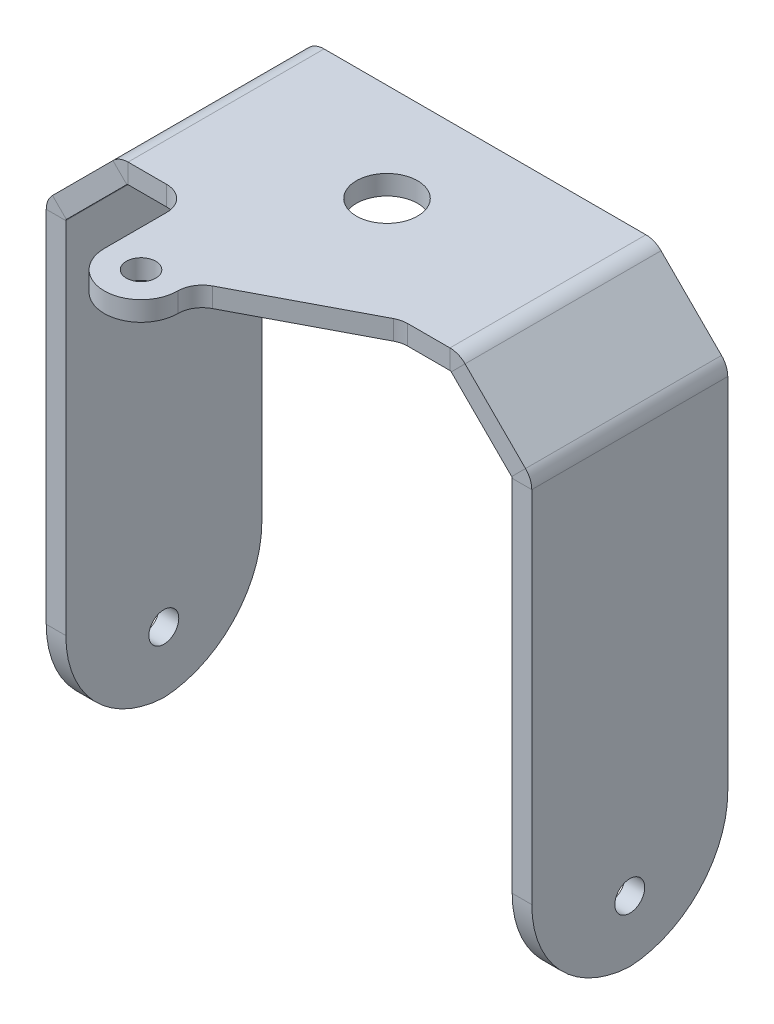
ISO-10303-21;
HEADER;
FILE_DESCRIPTION(('STEP AP214'),'2;1');
FILE_NAME('part.step','',(''),(''),'','','');
FILE_SCHEMA(('AUTOMOTIVE_DESIGN { 1 0 10303 214 1 1 1 1 }'));
ENDSEC;
DATA;
#1=APPLICATION_CONTEXT('core data for automotive mechanical design processes');
#2=APPLICATION_PROTOCOL_DEFINITION('international standard','automotive_design',2000,#1);
#3=PRODUCT_CONTEXT('',#1,'mechanical');
#4=PRODUCT('Part','Part','',(#3));
#5=PRODUCT_RELATED_PRODUCT_CATEGORY('part','',(#4));
#6=PRODUCT_DEFINITION_FORMATION('','',#4);
#7=PRODUCT_DEFINITION_CONTEXT('part definition',#1,'design');
#8=PRODUCT_DEFINITION('design','',#6,#7);
#9=PRODUCT_DEFINITION_SHAPE('','',#8);
#10=(LENGTH_UNIT() NAMED_UNIT(*) SI_UNIT(.MILLI.,.METRE.));
#11=(NAMED_UNIT(*) PLANE_ANGLE_UNIT() SI_UNIT($,.RADIAN.));
#12=(NAMED_UNIT(*) SI_UNIT($,.STERADIAN.) SOLID_ANGLE_UNIT());
#13=UNCERTAINTY_MEASURE_WITH_UNIT(LENGTH_MEASURE(1.E-05),#10,'distance_accuracy_value','');
#14=(GEOMETRIC_REPRESENTATION_CONTEXT(3) GLOBAL_UNCERTAINTY_ASSIGNED_CONTEXT((#13)) GLOBAL_UNIT_ASSIGNED_CONTEXT((#10,
#11,#12)) REPRESENTATION_CONTEXT('',''));
#15=CARTESIAN_POINT('',(0.,0.,0.));
#16=DIRECTION('',(0.,0.,1.));
#17=DIRECTION('',(1.,0.,0.));
#18=AXIS2_PLACEMENT_3D('',#15,#16,#17);
#19=CARTESIAN_POINT('',(99.1022907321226,-25.1022907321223,40.));
#20=DIRECTION('',(1.,0.,0.));
#21=DIRECTION('',(0.,1.,0.));
#22=AXIS2_PLACEMENT_3D('',#19,#20,#21);
#23=PLANE('',#22);
#24=CARTESIAN_POINT('',(99.1022907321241,-189.054644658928,0.));
#25=DIRECTION('',(1.,0.,0.));
#26=DIRECTION('',(0.,1.,0.));
#27=AXIS2_PLACEMENT_3D('',#24,#25,#26);
#28=CIRCLE('',#27,6.1);
#29=CARTESIAN_POINT('',(99.1022907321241,-182.954644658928,0.));
#30=VERTEX_POINT('',#29);
#31=EDGE_CURVE('E1169',#30,#30,#28,.T.);
#32=ORIENTED_EDGE('',*,*,#31,.F.);
#33=EDGE_LOOP('',(#32));
#34=FACE_BOUND('',#33,.T.);
#35=CARTESIAN_POINT('',(99.102290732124,-172.102290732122,-2.));
#36=DIRECTION('',(1.,0.,0.));
#37=DIRECTION('',(0.,1.,0.));
#38=AXIS2_PLACEMENT_3D('',#35,#36,#37);
#39=CIRCLE('',#38,42.);
#40=CARTESIAN_POINT('',(99.1022907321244,-214.054644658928,3.00107161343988E-13));
#41=VERTEX_POINT('',#40);
#42=CARTESIAN_POINT('',(99.102290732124,-172.102290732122,40.));
#43=VERTEX_POINT('',#42);
#44=EDGE_CURVE('E246',#41,#43,#39,.F.);
#45=ORIENTED_EDGE('',*,*,#44,.F.);
#46=CARTESIAN_POINT('',(99.102290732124,-172.102290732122,2.));
#47=DIRECTION('',(1.,0.,0.));
#48=DIRECTION('',(0.,1.,0.));
#49=AXIS2_PLACEMENT_3D('',#46,#47,#48);
#50=CIRCLE('',#49,42.);
#51=CARTESIAN_POINT('',(99.102290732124,-172.102290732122,-40.));
#52=VERTEX_POINT('',#51);
#53=EDGE_CURVE('E49',#41,#52,#50,.T.);
#54=ORIENTED_EDGE('',*,*,#53,.T.);
#55=DIRECTION('',(0.,-1.,0.));
#56=VECTOR('',#55,1.);
#57=CARTESIAN_POINT('',(99.1022907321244,-214.102290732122,-40.));
#58=LINE('',#57,#56);
#59=CARTESIAN_POINT('',(99.1022907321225,-25.4074004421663,-40.));
#60=VERTEX_POINT('',#59);
#61=EDGE_CURVE('E270',#60,#52,#58,.T.);
#62=ORIENTED_EDGE('',*,*,#61,.F.);
#63=DIRECTION('',(0.,0.,1.));
#64=VECTOR('',#63,1.);
#65=CARTESIAN_POINT('',(99.1022907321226,-25.4074004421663,40.));
#66=LINE('',#65,#64);
#67=CARTESIAN_POINT('',(99.1022907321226,-25.4074004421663,40.));
#68=VERTEX_POINT('',#67);
#69=EDGE_CURVE('E262',#60,#68,#66,.T.);
#70=ORIENTED_EDGE('',*,*,#69,.T.);
#71=DIRECTION('',(0.,1.,0.));
#72=VECTOR('',#71,1.);
#73=CARTESIAN_POINT('',(99.1022907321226,-25.1022907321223,40.));
#74=LINE('',#73,#72);
#75=EDGE_CURVE('E273',#43,#68,#74,.T.);
#76=ORIENTED_EDGE('',*,*,#75,.F.);
#77=EDGE_LOOP('',(#45,#54,#62,#70,#76));
#78=FACE_BOUND('',#77,.T.);
#79=ADVANCED_FACE('F33',(#34,#78),#23,.T.);
#80=CARTESIAN_POINT('',(91.1022907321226,-25.1022907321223,40.));
#81=DIRECTION('',(1.,0.,0.));
#82=DIRECTION('',(0.,1.,0.));
#83=AXIS2_PLACEMENT_3D('',#80,#81,#82);
#84=PLANE('',#83);
#85=CARTESIAN_POINT('',(91.1022907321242,-189.054644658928,0.));
#86=DIRECTION('',(1.,0.,0.));
#87=DIRECTION('',(0.,1.,0.));
#88=AXIS2_PLACEMENT_3D('',#85,#86,#87);
#89=CIRCLE('',#88,6.1);
#90=CARTESIAN_POINT('',(91.1022907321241,-182.954644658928,0.));
#91=VERTEX_POINT('',#90);
#92=EDGE_CURVE('E240',#91,#91,#89,.T.);
#93=ORIENTED_EDGE('',*,*,#92,.T.);
#94=EDGE_LOOP('',(#93));
#95=FACE_BOUND('',#94,.T.);
#96=CARTESIAN_POINT('',(91.102290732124,-172.102290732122,2.));
#97=DIRECTION('',(1.,0.,0.));
#98=DIRECTION('',(0.,1.,0.));
#99=AXIS2_PLACEMENT_3D('',#96,#97,#98);
#100=CIRCLE('',#99,42.);
#101=CARTESIAN_POINT('',(91.1022907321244,-214.054644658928,2.97071395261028E-13));
#102=VERTEX_POINT('',#101);
#103=CARTESIAN_POINT('',(91.1022907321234,-172.102290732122,-40.));
#104=VERTEX_POINT('',#103);
#105=EDGE_CURVE('E225',#102,#104,#100,.T.);
#106=ORIENTED_EDGE('',*,*,#105,.F.);
#107=CARTESIAN_POINT('',(91.102290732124,-172.102290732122,-2.));
#108=DIRECTION('',(1.,0.,0.));
#109=DIRECTION('',(0.,1.,0.));
#110=AXIS2_PLACEMENT_3D('',#107,#108,#109);
#111=CIRCLE('',#110,42.);
#112=CARTESIAN_POINT('',(91.1022907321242,-172.102290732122,40.));
#113=VERTEX_POINT('',#112);
#114=EDGE_CURVE('E235',#102,#113,#111,.F.);
#115=ORIENTED_EDGE('',*,*,#114,.T.);
#116=DIRECTION('',(0.,1.,0.));
#117=VECTOR('',#116,1.);
#118=CARTESIAN_POINT('',(91.1022907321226,-25.1022907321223,40.));
#119=LINE('',#118,#117);
#120=CARTESIAN_POINT('',(91.1022907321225,-25.4074004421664,40.));
#121=VERTEX_POINT('',#120);
#122=EDGE_CURVE('E268',#113,#121,#119,.T.);
#123=ORIENTED_EDGE('',*,*,#122,.T.);
#124=DIRECTION('',(0.,0.,1.));
#125=VECTOR('',#124,1.);
#126=CARTESIAN_POINT('',(91.1022907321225,-25.4074004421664,-40.));
#127=LINE('',#126,#125);
#128=CARTESIAN_POINT('',(91.1022907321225,-25.4074004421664,-40.));
#129=VERTEX_POINT('',#128);
#130=EDGE_CURVE('E256',#129,#121,#127,.T.);
#131=ORIENTED_EDGE('',*,*,#130,.F.);
#132=DIRECTION('',(0.,-1.,0.));
#133=VECTOR('',#132,1.);
#134=CARTESIAN_POINT('',(91.1022907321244,-214.102290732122,-40.));
#135=LINE('',#134,#133);
#136=EDGE_CURVE('E239',#129,#104,#135,.T.);
#137=ORIENTED_EDGE('',*,*,#136,.T.);
#138=EDGE_LOOP('',(#106,#115,#123,#131,#137));
#139=FACE_BOUND('',#138,.T.);
#140=ADVANCED_FACE('F234',(#95,#139),#84,.F.);
#141=CARTESIAN_POINT('',(91.102290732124,-172.102290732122,-2.));
#142=DIRECTION('',(1.,0.,0.));
#143=DIRECTION('',(0.,1.,0.));
#144=AXIS2_PLACEMENT_3D('',#141,#142,#143);
#145=CYLINDRICAL_SURFACE('',#144,42.);
#146=ORIENTED_EDGE('',*,*,#114,.F.);
#147=DIRECTION('',(-1.,0.,0.));
#148=VECTOR('',#147,1.);
#149=CARTESIAN_POINT('',(91.1022907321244,-214.054644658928,2.97071395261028E-13));
#150=LINE('',#149,#148);
#151=EDGE_CURVE('E222',#102,#41,#150,.F.);
#152=ORIENTED_EDGE('',*,*,#151,.T.);
#153=ORIENTED_EDGE('',*,*,#44,.T.);
#154=DIRECTION('',(-1.,0.,0.));
#155=VECTOR('',#154,1.);
#156=CARTESIAN_POINT('',(91.1022907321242,-172.102290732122,40.));
#157=LINE('',#156,#155);
#158=EDGE_CURVE('E244',#113,#43,#157,.F.);
#159=ORIENTED_EDGE('',*,*,#158,.F.);
#160=EDGE_LOOP('',(#146,#152,#153,#159));
#161=FACE_BOUND('',#160,.T.);
#162=ADVANCED_FACE('F242',(#161),#145,.T.);
#163=CARTESIAN_POINT('',(-99.1022907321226,-25.1022907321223,-40.));
#164=DIRECTION('',(-1.,0.,0.));
#165=DIRECTION('',(0.,-1.,0.));
#166=AXIS2_PLACEMENT_3D('',#163,#164,#165);
#167=PLANE('',#166);
#168=CARTESIAN_POINT('',(-99.1022907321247,-189.05464465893,1.29683751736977E-13));
#169=DIRECTION('',(1.,0.,0.));
#170=DIRECTION('',(0.,1.,0.));
#171=AXIS2_PLACEMENT_3D('',#168,#169,#170);
#172=CIRCLE('',#171,6.1);
#173=CARTESIAN_POINT('',(-99.1022907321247,-182.95464465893,1.29683751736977E-13));
#174=VERTEX_POINT('',#173);
#175=EDGE_CURVE('E1174',#174,#174,#172,.T.);
#176=ORIENTED_EDGE('',*,*,#175,.T.);
#177=EDGE_LOOP('',(#176));
#178=FACE_BOUND('',#177,.T.);
#179=DIRECTION('',(0.,1.,0.));
#180=VECTOR('',#179,1.);
#181=CARTESIAN_POINT('',(-99.1022907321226,-25.1022907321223,-40.));
#182=LINE('',#181,#180);
#183=CARTESIAN_POINT('',(-99.102290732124,-172.102290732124,-40.0000000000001));
#184=VERTEX_POINT('',#183);
#185=CARTESIAN_POINT('',(-99.1022907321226,-25.4074004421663,-40.));
#186=VERTEX_POINT('',#185);
#187=EDGE_CURVE('E318',#184,#186,#182,.T.);
#188=ORIENTED_EDGE('',*,*,#187,.F.);
#189=CARTESIAN_POINT('',(-99.102290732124,-172.102290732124,1.99999999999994));
#190=DIRECTION('',(-1.,0.,0.));
#191=DIRECTION('',(0.,-1.,0.));
#192=AXIS2_PLACEMENT_3D('',#189,#190,#191);
#193=CIRCLE('',#192,42.);
#194=CARTESIAN_POINT('',(-99.1022907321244,-214.054644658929,1.86656246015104E-11));
#195=VERTEX_POINT('',#194);
#196=EDGE_CURVE('E1181',#184,#195,#193,.T.);
#197=ORIENTED_EDGE('',*,*,#196,.T.);
#198=CARTESIAN_POINT('',(-99.102290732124,-172.102290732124,-1.99999999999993));
#199=DIRECTION('',(-1.,0.,0.));
#200=DIRECTION('',(0.,-1.,0.));
#201=AXIS2_PLACEMENT_3D('',#198,#199,#200);
#202=CIRCLE('',#201,42.);
#203=CARTESIAN_POINT('',(-99.102290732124,-172.102290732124,40.0000000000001));
#204=VERTEX_POINT('',#203);
#205=EDGE_CURVE('E250',#204,#195,#202,.F.);
#206=ORIENTED_EDGE('',*,*,#205,.F.);
#207=DIRECTION('',(0.,-1.,0.));
#208=VECTOR('',#207,1.);
#209=CARTESIAN_POINT('',(-99.1022907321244,-214.102290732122,40.));
#210=LINE('',#209,#208);
#211=CARTESIAN_POINT('',(-99.1022907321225,-25.4074004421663,40.));
#212=VERTEX_POINT('',#211);
#213=EDGE_CURVE('E315',#212,#204,#210,.T.);
#214=ORIENTED_EDGE('',*,*,#213,.F.);
#215=DIRECTION('',(0.,0.,-1.));
#216=VECTOR('',#215,1.);
#217=CARTESIAN_POINT('',(-99.1022907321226,-25.4074004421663,-40.));
#218=LINE('',#217,#216);
#219=EDGE_CURVE('E305',#212,#186,#218,.T.);
#220=ORIENTED_EDGE('',*,*,#219,.T.);
#221=EDGE_LOOP('',(#188,#197,#206,#214,#220));
#222=FACE_BOUND('',#221,.T.);
#223=ADVANCED_FACE('F665',(#178,#222),#167,.T.);
#224=CARTESIAN_POINT('',(-91.1022907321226,-25.1022907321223,-40.));
#225=DIRECTION('',(-1.,0.,0.));
#226=DIRECTION('',(0.,-1.,0.));
#227=AXIS2_PLACEMENT_3D('',#224,#225,#226);
#228=PLANE('',#227);
#229=CARTESIAN_POINT('',(-91.1022907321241,-189.05464465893,1.26908194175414E-13));
#230=DIRECTION('',(-1.,0.,0.));
#231=DIRECTION('',(0.,-1.,0.));
#232=AXIS2_PLACEMENT_3D('',#229,#230,#231);
#233=CIRCLE('',#232,6.1);
#234=CARTESIAN_POINT('',(-91.1022907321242,-195.15464465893,1.26908194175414E-13));
#235=VERTEX_POINT('',#234);
#236=EDGE_CURVE('E37',#235,#235,#233,.T.);
#237=ORIENTED_EDGE('',*,*,#236,.T.);
#238=EDGE_LOOP('',(#237));
#239=FACE_BOUND('',#238,.T.);
#240=CARTESIAN_POINT('',(-91.102290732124,-172.102290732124,1.99999999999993));
#241=DIRECTION('',(-1.,0.,0.));
#242=DIRECTION('',(0.,-1.,0.));
#243=AXIS2_PLACEMENT_3D('',#240,#241,#242);
#244=CIRCLE('',#243,42.);
#245=CARTESIAN_POINT('',(-91.1022907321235,-172.102290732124,-40.0000000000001));
#246=VERTEX_POINT('',#245);
#247=CARTESIAN_POINT('',(-91.1022907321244,-214.05464465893,0.));
#248=VERTEX_POINT('',#247);
#249=EDGE_CURVE('E57',#246,#248,#244,.T.);
#250=ORIENTED_EDGE('',*,*,#249,.F.);
#251=DIRECTION('',(0.,1.,0.));
#252=VECTOR('',#251,1.);
#253=CARTESIAN_POINT('',(-91.1022907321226,-25.1022907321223,-40.));
#254=LINE('',#253,#252);
#255=CARTESIAN_POINT('',(-91.1022907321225,-25.4074004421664,-40.));
#256=VERTEX_POINT('',#255);
#257=EDGE_CURVE('E313',#246,#256,#254,.T.);
#258=ORIENTED_EDGE('',*,*,#257,.T.);
#259=DIRECTION('',(0.,0.,-1.));
#260=VECTOR('',#259,1.);
#261=CARTESIAN_POINT('',(-91.1022907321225,-25.4074004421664,40.));
#262=LINE('',#261,#260);
#263=CARTESIAN_POINT('',(-91.1022907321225,-25.4074004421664,40.));
#264=VERTEX_POINT('',#263);
#265=EDGE_CURVE('E299',#264,#256,#262,.T.);
#266=ORIENTED_EDGE('',*,*,#265,.F.);
#267=DIRECTION('',(0.,-1.,0.));
#268=VECTOR('',#267,1.);
#269=CARTESIAN_POINT('',(-91.1022907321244,-214.102290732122,40.));
#270=LINE('',#269,#268);
#271=CARTESIAN_POINT('',(-91.1022907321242,-172.102290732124,40.0000000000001));
#272=VERTEX_POINT('',#271);
#273=EDGE_CURVE('E310',#264,#272,#270,.T.);
#274=ORIENTED_EDGE('',*,*,#273,.T.);
#275=CARTESIAN_POINT('',(-91.102290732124,-172.102290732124,-1.99999999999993));
#276=DIRECTION('',(-1.,0.,0.));
#277=DIRECTION('',(0.,-1.,0.));
#278=AXIS2_PLACEMENT_3D('',#275,#276,#277);
#279=CIRCLE('',#278,42.);
#280=EDGE_CURVE('E1187',#272,#248,#279,.F.);
#281=ORIENTED_EDGE('',*,*,#280,.T.);
#282=EDGE_LOOP('',(#250,#258,#266,#274,#281));
#283=FACE_BOUND('',#282,.T.);
#284=ADVANCED_FACE('F669',(#239,#283),#228,.F.);
#285=CARTESIAN_POINT('',(-99.1022907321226,-25.1022907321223,-40.));
#286=DIRECTION('',(0.,0.,-1.));
#287=DIRECTION('',(-1.,0.,0.));
#288=AXIS2_PLACEMENT_3D('',#285,#286,#287);
#289=PLANE('',#288);
#290=ORIENTED_EDGE('',*,*,#257,.F.);
#291=DIRECTION('',(1.,0.,0.));
#292=VECTOR('',#291,1.);
#293=CARTESIAN_POINT('',(-91.1022907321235,-172.102290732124,-40.0000000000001));
#294=LINE('',#293,#292);
#295=EDGE_CURVE('E1184',#246,#184,#294,.F.);
#296=ORIENTED_EDGE('',*,*,#295,.T.);
#297=ORIENTED_EDGE('',*,*,#187,.T.);
#298=DIRECTION('',(-1.,0.,0.));
#299=VECTOR('',#298,1.);
#300=CARTESIAN_POINT('',(-91.1022907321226,-25.4074004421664,-40.));
#301=LINE('',#300,#299);
#302=EDGE_CURVE('E302',#256,#186,#301,.T.);
#303=ORIENTED_EDGE('',*,*,#302,.F.);
#304=EDGE_LOOP('',(#290,#296,#297,#303));
#305=FACE_BOUND('',#304,.T.);
#306=ADVANCED_FACE('F662',(#305),#289,.T.);
#307=CARTESIAN_POINT('',(-91.102290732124,-172.102290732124,-1.99999999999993));
#308=DIRECTION('',(-1.,0.,0.));
#309=DIRECTION('',(0.,-1.,0.));
#310=AXIS2_PLACEMENT_3D('',#307,#308,#309);
#311=CYLINDRICAL_SURFACE('',#310,42.);
#312=ORIENTED_EDGE('',*,*,#205,.T.);
#313=DIRECTION('',(1.,0.,0.));
#314=VECTOR('',#313,1.);
#315=CARTESIAN_POINT('',(-91.1022907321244,-214.054644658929,1.86656246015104E-11));
#316=LINE('',#315,#314);
#317=EDGE_CURVE('E1185',#248,#195,#316,.F.);
#318=ORIENTED_EDGE('',*,*,#317,.F.);
#319=ORIENTED_EDGE('',*,*,#280,.F.);
#320=DIRECTION('',(1.,0.,0.));
#321=VECTOR('',#320,1.);
#322=CARTESIAN_POINT('',(-91.1022907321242,-172.102290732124,40.0000000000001));
#323=LINE('',#322,#321);
#324=EDGE_CURVE('E247',#272,#204,#323,.F.);
#325=ORIENTED_EDGE('',*,*,#324,.T.);
#326=EDGE_LOOP('',(#312,#318,#319,#325));
#327=FACE_BOUND('',#326,.T.);
#328=ADVANCED_FACE('F647',(#327),#311,.T.);
#329=CARTESIAN_POINT('',(99.1022907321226,-25.1022907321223,40.));
#330=DIRECTION('',(0.,0.,1.));
#331=DIRECTION('',(1.,0.,0.));
#332=AXIS2_PLACEMENT_3D('',#329,#330,#331);
#333=PLANE('',#332);
#334=ORIENTED_EDGE('',*,*,#122,.F.);
#335=ORIENTED_EDGE('',*,*,#158,.T.);
#336=ORIENTED_EDGE('',*,*,#75,.T.);
#337=DIRECTION('',(1.,0.,0.));
#338=VECTOR('',#337,1.);
#339=CARTESIAN_POINT('',(91.1022907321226,-25.4074004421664,40.));
#340=LINE('',#339,#338);
#341=EDGE_CURVE('E259',#121,#68,#340,.T.);
#342=ORIENTED_EDGE('',*,*,#341,.F.);
#343=EDGE_LOOP('',(#334,#335,#336,#342));
#344=FACE_BOUND('',#343,.T.);
#345=ADVANCED_FACE('F619',(#344),#333,.T.);
#346=CARTESIAN_POINT('',(96.7591449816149,-19.4454364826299,40.));
#347=DIRECTION('',(0.,0.,1.));
#348=DIRECTION('',(0.,-1.,0.));
#349=AXIS2_PLACEMENT_3D('',#346,#347,#348);
#350=PLANE('',#349);
#351=DIRECTION('',(-0.707106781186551,0.707106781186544,0.));
#352=VECTOR('',#351,1.);
#353=CARTESIAN_POINT('',(91.1022907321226,-25.1022907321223,40.));
#354=LINE('',#353,#352);
#355=CARTESIAN_POINT('',(90.8865455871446,-24.8865455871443,40.));
#356=VERTEX_POINT('',#355);
#357=CARTESIAN_POINT('',(66.215745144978,-0.215745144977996,40.));
#358=VERTEX_POINT('',#357);
#359=EDGE_CURVE('E357',#356,#358,#354,.T.);
#360=ORIENTED_EDGE('',*,*,#359,.F.);
#361=DIRECTION('',(0.707106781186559,0.707106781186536,0.));
#362=VECTOR('',#361,1.);
#363=CARTESIAN_POINT('',(90.8865455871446,-24.8865455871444,40.));
#364=LINE('',#363,#362);
#365=CARTESIAN_POINT('',(96.543399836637,-19.2296913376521,40.));
#366=VERTEX_POINT('',#365);
#367=EDGE_CURVE('E290',#356,#366,#364,.T.);
#368=ORIENTED_EDGE('',*,*,#367,.T.);
#369=DIRECTION('',(-0.707106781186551,0.707106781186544,0.));
#370=VECTOR('',#369,1.);
#371=CARTESIAN_POINT('',(96.7591449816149,-19.4454364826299,40.));
#372=LINE('',#371,#370);
#373=CARTESIAN_POINT('',(71.8725993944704,5.44110910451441,40.));
#374=VERTEX_POINT('',#373);
#375=EDGE_CURVE('E362',#366,#374,#372,.T.);
#376=ORIENTED_EDGE('',*,*,#375,.T.);
#377=DIRECTION('',(0.707106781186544,0.707106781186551,0.));
#378=VECTOR('',#377,1.);
#379=CARTESIAN_POINT('',(66.215745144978,-0.215745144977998,40.));
#380=LINE('',#379,#378);
#381=EDGE_CURVE('E347',#358,#374,#380,.T.);
#382=ORIENTED_EDGE('',*,*,#381,.F.);
#383=EDGE_LOOP('',(#360,#368,#376,#382));
#384=FACE_BOUND('',#383,.T.);
#385=ADVANCED_FACE('F593',(#384),#350,.T.);
#386=CARTESIAN_POINT('',(71.6568542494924,5.65685424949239,40.));
#387=DIRECTION('',(-0.707106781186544,-0.707106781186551,0.));
#388=DIRECTION('',(0.707106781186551,-0.707106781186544,0.));
#389=AXIS2_PLACEMENT_3D('',#386,#387,#388);
#390=PLANE('',#389);
#391=DIRECTION('',(0.,0.,1.));
#392=VECTOR('',#391,1.);
#393=CARTESIAN_POINT('',(96.543399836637,-19.2296913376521,40.));
#394=LINE('',#393,#392);
#395=CARTESIAN_POINT('',(96.5433998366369,-19.229691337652,-40.));
#396=VERTEX_POINT('',#395);
#397=EDGE_CURVE('E285',#366,#396,#394,.F.);
#398=ORIENTED_EDGE('',*,*,#397,.T.);
#399=DIRECTION('',(0.707106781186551,-0.707106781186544,0.));
#400=VECTOR('',#399,1.);
#401=CARTESIAN_POINT('',(71.6568542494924,5.6568542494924,-40.));
#402=LINE('',#401,#400);
#403=CARTESIAN_POINT('',(71.8725993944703,5.44110910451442,-40.));
#404=VERTEX_POINT('',#403);
#405=EDGE_CURVE('E359',#404,#396,#402,.T.);
#406=ORIENTED_EDGE('',*,*,#405,.F.);
#407=DIRECTION('',(0.,0.,-1.));
#408=VECTOR('',#407,1.);
#409=CARTESIAN_POINT('',(71.8725993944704,5.44110910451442,40.));
#410=LINE('',#409,#408);
#411=EDGE_CURVE('E350',#374,#404,#410,.T.);
#412=ORIENTED_EDGE('',*,*,#411,.F.);
#413=ORIENTED_EDGE('',*,*,#375,.F.);
#414=EDGE_LOOP('',(#398,#406,#412,#413));
#415=FACE_BOUND('',#414,.T.);
#416=ADVANCED_FACE('F597',(#415),#390,.F.);
#417=CARTESIAN_POINT('',(66.,0.,40.));
#418=DIRECTION('',(-0.707106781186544,-0.707106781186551,0.));
#419=DIRECTION('',(0.707106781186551,-0.707106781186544,0.));
#420=AXIS2_PLACEMENT_3D('',#417,#418,#419);
#421=PLANE('',#420);
#422=DIRECTION('',(0.707106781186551,-0.707106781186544,0.));
#423=VECTOR('',#422,1.);
#424=CARTESIAN_POINT('',(66.,0.,-40.));
#425=LINE('',#424,#423);
#426=CARTESIAN_POINT('',(66.215745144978,-0.215745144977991,-40.));
#427=VERTEX_POINT('',#426);
#428=CARTESIAN_POINT('',(90.8865455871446,-24.8865455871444,-40.));
#429=VERTEX_POINT('',#428);
#430=EDGE_CURVE('E354',#427,#429,#425,.T.);
#431=ORIENTED_EDGE('',*,*,#430,.T.);
#432=DIRECTION('',(0.,0.,1.));
#433=VECTOR('',#432,1.);
#434=CARTESIAN_POINT('',(90.8865455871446,-24.8865455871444,40.));
#435=LINE('',#434,#433);
#436=EDGE_CURVE('E280',#356,#429,#435,.F.);
#437=ORIENTED_EDGE('',*,*,#436,.F.);
#438=ORIENTED_EDGE('',*,*,#359,.T.);
#439=DIRECTION('',(0.,0.,1.));
#440=VECTOR('',#439,1.);
#441=CARTESIAN_POINT('',(66.215745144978,-0.215745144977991,-40.));
#442=LINE('',#441,#440);
#443=EDGE_CURVE('E344',#427,#358,#442,.T.);
#444=ORIENTED_EDGE('',*,*,#443,.F.);
#445=EDGE_LOOP('',(#431,#437,#438,#444));
#446=FACE_BOUND('',#445,.T.);
#447=ADVANCED_FACE('F697',(#446),#421,.T.);
#448=CARTESIAN_POINT('',(-71.6568542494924,5.6568542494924,-40.));
#449=DIRECTION('',(0.,0.,-1.));
#450=DIRECTION('',(-1.,0.,0.));
#451=AXIS2_PLACEMENT_3D('',#448,#449,#450);
#452=PLANE('',#451);
#453=DIRECTION('',(0.707106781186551,0.707106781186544,0.));
#454=VECTOR('',#453,1.);
#455=CARTESIAN_POINT('',(-66.,0.,-40.));
#456=LINE('',#455,#454);
#457=CARTESIAN_POINT('',(-90.8865455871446,-24.8865455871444,-40.));
#458=VERTEX_POINT('',#457);
#459=CARTESIAN_POINT('',(-66.215745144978,-0.215745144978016,-40.));
#460=VERTEX_POINT('',#459);
#461=EDGE_CURVE('E402',#458,#460,#456,.T.);
#462=ORIENTED_EDGE('',*,*,#461,.F.);
#463=DIRECTION('',(-0.707106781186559,0.707106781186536,0.));
#464=VECTOR('',#463,1.);
#465=CARTESIAN_POINT('',(-90.8865455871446,-24.8865455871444,-40.));
#466=LINE('',#465,#464);
#467=CARTESIAN_POINT('',(-96.543399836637,-19.2296913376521,-40.));
#468=VERTEX_POINT('',#467);
#469=EDGE_CURVE('E335',#458,#468,#466,.T.);
#470=ORIENTED_EDGE('',*,*,#469,.T.);
#471=DIRECTION('',(0.707106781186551,0.707106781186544,0.));
#472=VECTOR('',#471,1.);
#473=CARTESIAN_POINT('',(-71.6568542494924,5.6568542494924,-40.));
#474=LINE('',#473,#472);
#475=CARTESIAN_POINT('',(-71.8725993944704,5.44110910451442,-40.));
#476=VERTEX_POINT('',#475);
#477=EDGE_CURVE('E407',#468,#476,#474,.T.);
#478=ORIENTED_EDGE('',*,*,#477,.T.);
#479=DIRECTION('',(-0.707106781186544,0.707106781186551,0.));
#480=VECTOR('',#479,1.);
#481=CARTESIAN_POINT('',(-66.215745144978,-0.215745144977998,-40.));
#482=LINE('',#481,#480);
#483=EDGE_CURVE('E391',#460,#476,#482,.T.);
#484=ORIENTED_EDGE('',*,*,#483,.F.);
#485=EDGE_LOOP('',(#462,#470,#478,#484));
#486=FACE_BOUND('',#485,.T.);
#487=ADVANCED_FACE('F559',(#486),#452,.T.);
#488=CARTESIAN_POINT('',(-71.6568542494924,5.6568542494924,-40.));
#489=DIRECTION('',(-0.707106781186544,0.707106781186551,0.));
#490=DIRECTION('',(-0.707106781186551,-0.707106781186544,0.));
#491=AXIS2_PLACEMENT_3D('',#488,#489,#490);
#492=PLANE('',#491);
#493=ORIENTED_EDGE('',*,*,#477,.F.);
#494=DIRECTION('',(0.,0.,-1.));
#495=VECTOR('',#494,1.);
#496=CARTESIAN_POINT('',(-96.543399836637,-19.2296913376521,-40.));
#497=LINE('',#496,#495);
#498=CARTESIAN_POINT('',(-96.5433998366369,-19.229691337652,40.));
#499=VERTEX_POINT('',#498);
#500=EDGE_CURVE('E329',#468,#499,#497,.F.);
#501=ORIENTED_EDGE('',*,*,#500,.T.);
#502=DIRECTION('',(-0.70710678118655,-0.707106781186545,0.));
#503=VECTOR('',#502,1.);
#504=CARTESIAN_POINT('',(-96.7591449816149,-19.4454364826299,40.));
#505=LINE('',#504,#503);
#506=CARTESIAN_POINT('',(-71.8725993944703,5.44110910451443,40.));
#507=VERTEX_POINT('',#506);
#508=EDGE_CURVE('E404',#507,#499,#505,.T.);
#509=ORIENTED_EDGE('',*,*,#508,.F.);
#510=DIRECTION('',(0.,0.,-1.));
#511=VECTOR('',#510,1.);
#512=CARTESIAN_POINT('',(-71.8725993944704,5.4411091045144,-40.));
#513=LINE('',#512,#511);
#514=EDGE_CURVE('E394',#507,#476,#513,.T.);
#515=ORIENTED_EDGE('',*,*,#514,.T.);
#516=EDGE_LOOP('',(#493,#501,#509,#515));
#517=FACE_BOUND('',#516,.T.);
#518=ADVANCED_FACE('F549',(#517),#492,.T.);
#519=CARTESIAN_POINT('',(-66.,0.,-40.));
#520=DIRECTION('',(-0.707106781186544,0.707106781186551,0.));
#521=DIRECTION('',(-0.707106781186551,-0.707106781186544,0.));
#522=AXIS2_PLACEMENT_3D('',#519,#520,#521);
#523=PLANE('',#522);
#524=DIRECTION('',(0.,0.,-1.));
#525=VECTOR('',#524,1.);
#526=CARTESIAN_POINT('',(-90.8865455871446,-24.8865455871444,-40.));
#527=LINE('',#526,#525);
#528=CARTESIAN_POINT('',(-90.8865455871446,-24.8865455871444,40.));
#529=VERTEX_POINT('',#528);
#530=EDGE_CURVE('E325',#458,#529,#527,.F.);
#531=ORIENTED_EDGE('',*,*,#530,.F.);
#532=ORIENTED_EDGE('',*,*,#461,.T.);
#533=DIRECTION('',(0.,0.,-1.));
#534=VECTOR('',#533,1.);
#535=CARTESIAN_POINT('',(-66.215745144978,-0.215745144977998,40.));
#536=LINE('',#535,#534);
#537=CARTESIAN_POINT('',(-66.215745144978,-0.215745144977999,40.));
#538=VERTEX_POINT('',#537);
#539=EDGE_CURVE('E388',#538,#460,#536,.T.);
#540=ORIENTED_EDGE('',*,*,#539,.F.);
#541=DIRECTION('',(-0.70710678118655,-0.707106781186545,0.));
#542=VECTOR('',#541,1.);
#543=CARTESIAN_POINT('',(-91.1022907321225,-25.1022907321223,40.));
#544=LINE('',#543,#542);
#545=EDGE_CURVE('E399',#538,#529,#544,.T.);
#546=ORIENTED_EDGE('',*,*,#545,.T.);
#547=EDGE_LOOP('',(#531,#532,#540,#546));
#548=FACE_BOUND('',#547,.T.);
#549=ADVANCED_FACE('F564',(#548),#523,.F.);
#550=CARTESIAN_POINT('',(-50.,8.,50.));
#551=DIRECTION('',(0.,1.,0.));
#552=DIRECTION('',(0.,0.,1.));
#553=AXIS2_PLACEMENT_3D('',#550,#551,#552);
#554=PLANE('',#553);
#555=CARTESIAN_POINT('',(0.,8.,0.));
#556=DIRECTION('',(0.,1.,0.));
#557=DIRECTION('',(0.,0.,1.));
#558=AXIS2_PLACEMENT_3D('',#555,#556,#557);
#559=CIRCLE('',#558,12.5);
#560=CARTESIAN_POINT('',(0.,8.,12.5));
#561=VERTEX_POINT('',#560);
#562=EDGE_CURVE('E441',#561,#561,#559,.T.);
#563=ORIENTED_EDGE('',*,*,#562,.F.);
#564=EDGE_LOOP('',(#563));
#565=FACE_BOUND('',#564,.T.);
#566=CARTESIAN_POINT('',(-25.,8.,75.4));
#567=DIRECTION('',(0.,1.,0.));
#568=DIRECTION('',(0.,0.,1.));
#569=AXIS2_PLACEMENT_3D('',#566,#567,#568);
#570=CIRCLE('',#569,6.);
#571=CARTESIAN_POINT('',(-25.,8.,81.4));
#572=VERTEX_POINT('',#571);
#573=EDGE_CURVE('E435',#572,#572,#570,.T.);
#574=ORIENTED_EDGE('',*,*,#573,.F.);
#575=EDGE_LOOP('',(#574));
#576=FACE_BOUND('',#575,.T.);
#577=DIRECTION('',(1.,0.,0.));
#578=VECTOR('',#577,1.);
#579=CARTESIAN_POINT('',(48.4617992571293,8.,40.));
#580=LINE('',#579,#578);
#581=CARTESIAN_POINT('',(48.4617992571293,8.,40.));
#582=VERTEX_POINT('',#581);
#583=CARTESIAN_POINT('',(65.6948902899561,7.99999999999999,40.));
#584=VERTEX_POINT('',#583);
#585=EDGE_CURVE('E478',#582,#584,#580,.T.);
#586=ORIENTED_EDGE('',*,*,#585,.T.);
#587=DIRECTION('',(0.,0.,1.));
#588=VECTOR('',#587,1.);
#589=CARTESIAN_POINT('',(65.6948902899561,7.99999999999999,40.));
#590=LINE('',#589,#588);
#591=CARTESIAN_POINT('',(65.694890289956,8.,-40.));
#592=VERTEX_POINT('',#591);
#593=EDGE_CURVE('E373',#584,#592,#590,.F.);
#594=ORIENTED_EDGE('',*,*,#593,.T.);
#595=DIRECTION('',(-1.,0.,0.));
#596=VECTOR('',#595,1.);
#597=CARTESIAN_POINT('',(-66.,8.,-40.));
#598=LINE('',#597,#596);
#599=CARTESIAN_POINT('',(-65.6948902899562,7.99999999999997,-40.));
#600=VERTEX_POINT('',#599);
#601=EDGE_CURVE('E481',#592,#600,#598,.T.);
#602=ORIENTED_EDGE('',*,*,#601,.T.);
#603=DIRECTION('',(0.,0.,-1.));
#604=VECTOR('',#603,1.);
#605=CARTESIAN_POINT('',(-65.6948902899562,7.99999999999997,-40.));
#606=LINE('',#605,#604);
#607=CARTESIAN_POINT('',(-65.694890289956,8.,40.));
#608=VERTEX_POINT('',#607);
#609=EDGE_CURVE('E418',#600,#608,#606,.F.);
#610=ORIENTED_EDGE('',*,*,#609,.T.);
#611=DIRECTION('',(1.,0.,0.));
#612=VECTOR('',#611,1.);
#613=CARTESIAN_POINT('',(-66.,8.,40.));
#614=LINE('',#613,#612);
#615=CARTESIAN_POINT('',(-50.,8.,40.));
#616=VERTEX_POINT('',#615);
#617=EDGE_CURVE('E464',#608,#616,#614,.T.);
#618=ORIENTED_EDGE('',*,*,#617,.T.);
#619=CARTESIAN_POINT('',(-50.,8.,50.));
#620=DIRECTION('',(0.,-1.,0.));
#621=DIRECTION('',(0.,0.,1.));
#622=AXIS2_PLACEMENT_3D('',#619,#620,#621);
#623=CIRCLE('',#622,10.);
#624=CARTESIAN_POINT('',(-40.,8.,50.));
#625=VERTEX_POINT('',#624);
#626=EDGE_CURVE('E466',#616,#625,#623,.T.);
#627=ORIENTED_EDGE('',*,*,#626,.T.);
#628=DIRECTION('',(0.,0.,1.));
#629=VECTOR('',#628,1.);
#630=CARTESIAN_POINT('',(-40.,8.,50.));
#631=LINE('',#630,#629);
#632=CARTESIAN_POINT('',(-40.,8.,75.4));
#633=VERTEX_POINT('',#632);
#634=EDGE_CURVE('E468',#625,#633,#631,.T.);
#635=ORIENTED_EDGE('',*,*,#634,.T.);
#636=CARTESIAN_POINT('',(-25.,8.,75.4));
#637=DIRECTION('',(0.,1.,0.));
#638=DIRECTION('',(0.,0.,1.));
#639=AXIS2_PLACEMENT_3D('',#636,#637,#638);
#640=CIRCLE('',#639,15.);
#641=CARTESIAN_POINT('',(-10.,8.,75.4));
#642=VERTEX_POINT('',#641);
#643=EDGE_CURVE('E470',#633,#642,#640,.T.);
#644=ORIENTED_EDGE('',*,*,#643,.T.);
#645=CARTESIAN_POINT('',(0.,8.,75.4));
#646=DIRECTION('',(0.,-1.,0.));
#647=DIRECTION('',(0.,0.,1.));
#648=AXIS2_PLACEMENT_3D('',#645,#646,#647);
#649=CIRCLE('',#648,10.);
#650=CARTESIAN_POINT('',(-4.64225661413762,8.,66.5428303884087));
#651=VERTEX_POINT('',#650);
#652=EDGE_CURVE('E472',#642,#651,#649,.T.);
#653=ORIENTED_EDGE('',*,*,#652,.T.);
#654=DIRECTION('',(0.885716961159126,0.,-0.464225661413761));
#655=VECTOR('',#654,1.);
#656=CARTESIAN_POINT('',(-4.64225661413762,8.,66.5428303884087));
#657=LINE('',#656,#655);
#658=CARTESIAN_POINT('',(43.8195426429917,8.,41.1428303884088));
#659=VERTEX_POINT('',#658);
#660=EDGE_CURVE('E474',#651,#659,#657,.T.);
#661=ORIENTED_EDGE('',*,*,#660,.T.);
#662=CARTESIAN_POINT('',(48.4617992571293,8.,50.));
#663=DIRECTION('',(0.,-1.,0.));
#664=DIRECTION('',(0.,0.,1.));
#665=AXIS2_PLACEMENT_3D('',#662,#663,#664);
#666=CIRCLE('',#665,9.99999999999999);
#667=EDGE_CURVE('E476',#659,#582,#666,.T.);
#668=ORIENTED_EDGE('',*,*,#667,.T.);
#669=EDGE_LOOP('',(#586,#594,#602,#610,#618,#627,#635,#644,#653,#661,#668));
#670=FACE_BOUND('',#669,.T.);
#671=ADVANCED_FACE('F526',(#565,#576,#670),#554,.T.);
#672=CARTESIAN_POINT('',(-50.,0.,50.));
#673=DIRECTION('',(0.,1.,0.));
#674=DIRECTION('',(0.,0.,1.));
#675=AXIS2_PLACEMENT_3D('',#672,#673,#674);
#676=PLANE('',#675);
#677=CARTESIAN_POINT('',(0.,0.,0.));
#678=DIRECTION('',(0.,1.,0.));
#679=DIRECTION('',(0.,0.,1.));
#680=AXIS2_PLACEMENT_3D('',#677,#678,#679);
#681=CIRCLE('',#680,12.5);
#682=CARTESIAN_POINT('',(0.,0.,12.5));
#683=VERTEX_POINT('',#682);
#684=EDGE_CURVE('E438',#683,#683,#681,.T.);
#685=ORIENTED_EDGE('',*,*,#684,.T.);
#686=EDGE_LOOP('',(#685));
#687=FACE_BOUND('',#686,.T.);
#688=CARTESIAN_POINT('',(-25.,0.,75.4));
#689=DIRECTION('',(0.,1.,0.));
#690=DIRECTION('',(0.,0.,1.));
#691=AXIS2_PLACEMENT_3D('',#688,#689,#690);
#692=CIRCLE('',#691,6.);
#693=CARTESIAN_POINT('',(-25.,0.,81.4));
#694=VERTEX_POINT('',#693);
#695=EDGE_CURVE('E430',#694,#694,#692,.T.);
#696=ORIENTED_EDGE('',*,*,#695,.T.);
#697=EDGE_LOOP('',(#696));
#698=FACE_BOUND('',#697,.T.);
#699=DIRECTION('',(0.,0.,1.));
#700=VECTOR('',#699,1.);
#701=CARTESIAN_POINT('',(65.694890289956,0.,40.));
#702=LINE('',#701,#700);
#703=CARTESIAN_POINT('',(65.694890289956,0.,40.));
#704=VERTEX_POINT('',#703);
#705=CARTESIAN_POINT('',(65.694890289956,0.,-40.));
#706=VERTEX_POINT('',#705);
#707=EDGE_CURVE('E369',#704,#706,#702,.F.);
#708=ORIENTED_EDGE('',*,*,#707,.F.);
#709=DIRECTION('',(1.,0.,0.));
#710=VECTOR('',#709,1.);
#711=CARTESIAN_POINT('',(48.4617992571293,0.,40.));
#712=LINE('',#711,#710);
#713=CARTESIAN_POINT('',(48.4617992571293,0.,40.));
#714=VERTEX_POINT('',#713);
#715=EDGE_CURVE('E458',#714,#704,#712,.T.);
#716=ORIENTED_EDGE('',*,*,#715,.F.);
#717=CARTESIAN_POINT('',(48.4617992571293,0.,50.));
#718=DIRECTION('',(0.,-1.,0.));
#719=DIRECTION('',(0.,0.,1.));
#720=AXIS2_PLACEMENT_3D('',#717,#718,#719);
#721=CIRCLE('',#720,9.99999999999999);
#722=CARTESIAN_POINT('',(43.8195426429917,0.,41.1428303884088));
#723=VERTEX_POINT('',#722);
#724=EDGE_CURVE('E456',#723,#714,#721,.T.);
#725=ORIENTED_EDGE('',*,*,#724,.F.);
#726=DIRECTION('',(0.885716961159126,0.,-0.464225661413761));
#727=VECTOR('',#726,1.);
#728=CARTESIAN_POINT('',(-4.64225661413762,0.,66.5428303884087));
#729=LINE('',#728,#727);
#730=CARTESIAN_POINT('',(-4.64225661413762,0.,66.5428303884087));
#731=VERTEX_POINT('',#730);
#732=EDGE_CURVE('E454',#731,#723,#729,.T.);
#733=ORIENTED_EDGE('',*,*,#732,.F.);
#734=CARTESIAN_POINT('',(0.,0.,75.4));
#735=DIRECTION('',(0.,-1.,0.));
#736=DIRECTION('',(0.,0.,1.));
#737=AXIS2_PLACEMENT_3D('',#734,#735,#736);
#738=CIRCLE('',#737,10.);
#739=CARTESIAN_POINT('',(-10.,0.,75.4));
#740=VERTEX_POINT('',#739);
#741=EDGE_CURVE('E452',#740,#731,#738,.T.);
#742=ORIENTED_EDGE('',*,*,#741,.F.);
#743=CARTESIAN_POINT('',(-25.,0.,75.4));
#744=DIRECTION('',(0.,1.,0.));
#745=DIRECTION('',(0.,0.,1.));
#746=AXIS2_PLACEMENT_3D('',#743,#744,#745);
#747=CIRCLE('',#746,15.);
#748=CARTESIAN_POINT('',(-40.,0.,75.4));
#749=VERTEX_POINT('',#748);
#750=EDGE_CURVE('E450',#749,#740,#747,.T.);
#751=ORIENTED_EDGE('',*,*,#750,.F.);
#752=DIRECTION('',(0.,0.,1.));
#753=VECTOR('',#752,1.);
#754=CARTESIAN_POINT('',(-40.,0.,50.));
#755=LINE('',#754,#753);
#756=CARTESIAN_POINT('',(-40.,0.,50.));
#757=VERTEX_POINT('',#756);
#758=EDGE_CURVE('E448',#757,#749,#755,.T.);
#759=ORIENTED_EDGE('',*,*,#758,.F.);
#760=CARTESIAN_POINT('',(-50.,0.,50.));
#761=DIRECTION('',(0.,-1.,0.));
#762=DIRECTION('',(0.,0.,1.));
#763=AXIS2_PLACEMENT_3D('',#760,#761,#762);
#764=CIRCLE('',#763,10.);
#765=CARTESIAN_POINT('',(-50.,0.,40.));
#766=VERTEX_POINT('',#765);
#767=EDGE_CURVE('E446',#766,#757,#764,.T.);
#768=ORIENTED_EDGE('',*,*,#767,.F.);
#769=DIRECTION('',(1.,0.,0.));
#770=VECTOR('',#769,1.);
#771=CARTESIAN_POINT('',(-66.,0.,40.));
#772=LINE('',#771,#770);
#773=CARTESIAN_POINT('',(-65.694890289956,0.,40.));
#774=VERTEX_POINT('',#773);
#775=EDGE_CURVE('E444',#774,#766,#772,.T.);
#776=ORIENTED_EDGE('',*,*,#775,.F.);
#777=DIRECTION('',(0.,0.,-1.));
#778=VECTOR('',#777,1.);
#779=CARTESIAN_POINT('',(-65.694890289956,0.,-40.));
#780=LINE('',#779,#778);
#781=CARTESIAN_POINT('',(-65.694890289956,0.,-40.));
#782=VERTEX_POINT('',#781);
#783=EDGE_CURVE('E414',#782,#774,#780,.F.);
#784=ORIENTED_EDGE('',*,*,#783,.F.);
#785=DIRECTION('',(-1.,0.,0.));
#786=VECTOR('',#785,1.);
#787=CARTESIAN_POINT('',(-66.,0.,-40.));
#788=LINE('',#787,#786);
#789=EDGE_CURVE('E461',#706,#782,#788,.T.);
#790=ORIENTED_EDGE('',*,*,#789,.F.);
#791=EDGE_LOOP('',(#708,#716,#725,#733,#742,#751,#759,#768,#776,#784,#790));
#792=FACE_BOUND('',#791,.T.);
#793=ADVANCED_FACE('F512',(#687,#698,#792),#676,.F.);
#794=CARTESIAN_POINT('',(-66.,8.,-40.));
#795=DIRECTION('',(0.,0.,1.));
#796=DIRECTION('',(1.,0.,0.));
#797=AXIS2_PLACEMENT_3D('',#794,#795,#796);
#798=PLANE('',#797);
#799=DIRECTION('',(0.,1.,0.));
#800=VECTOR('',#799,1.);
#801=CARTESIAN_POINT('',(65.694890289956,0.,-40.));
#802=LINE('',#801,#800);
#803=EDGE_CURVE('E382',#706,#592,#802,.T.);
#804=ORIENTED_EDGE('',*,*,#803,.F.);
#805=ORIENTED_EDGE('',*,*,#789,.T.);
#806=DIRECTION('',(0.,1.,0.));
#807=VECTOR('',#806,1.);
#808=CARTESIAN_POINT('',(-65.694890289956,0.,-40.));
#809=LINE('',#808,#807);
#810=EDGE_CURVE('E424',#782,#600,#809,.T.);
#811=ORIENTED_EDGE('',*,*,#810,.T.);
#812=ORIENTED_EDGE('',*,*,#601,.F.);
#813=EDGE_LOOP('',(#804,#805,#811,#812));
#814=FACE_BOUND('',#813,.T.);
#815=ADVANCED_FACE('F570',(#814),#798,.F.);
#816=CARTESIAN_POINT('',(48.4617992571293,8.,40.));
#817=DIRECTION('',(0.,0.,-1.));
#818=DIRECTION('',(-1.,0.,0.));
#819=AXIS2_PLACEMENT_3D('',#816,#817,#818);
#820=PLANE('',#819);
#821=DIRECTION('',(0.,1.,0.));
#822=VECTOR('',#821,1.);
#823=CARTESIAN_POINT('',(65.694890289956,0.,40.));
#824=LINE('',#823,#822);
#825=EDGE_CURVE('E379',#704,#584,#824,.T.);
#826=ORIENTED_EDGE('',*,*,#825,.T.);
#827=ORIENTED_EDGE('',*,*,#585,.F.);
#828=DIRECTION('',(0.,-1.,0.));
#829=VECTOR('',#828,1.);
#830=CARTESIAN_POINT('',(48.4617992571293,8.,40.));
#831=LINE('',#830,#829);
#832=EDGE_CURVE('E484',#582,#714,#831,.T.);
#833=ORIENTED_EDGE('',*,*,#832,.T.);
#834=ORIENTED_EDGE('',*,*,#715,.T.);
#835=EDGE_LOOP('',(#826,#827,#833,#834));
#836=FACE_BOUND('',#835,.T.);
#837=ADVANCED_FACE('F584',(#836),#820,.F.);
#838=CARTESIAN_POINT('',(-66.,8.,40.));
#839=DIRECTION('',(0.,0.,-1.));
#840=DIRECTION('',(-1.,0.,0.));
#841=AXIS2_PLACEMENT_3D('',#838,#839,#840);
#842=PLANE('',#841);
#843=DIRECTION('',(0.,1.,0.));
#844=VECTOR('',#843,1.);
#845=CARTESIAN_POINT('',(-65.694890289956,0.,40.));
#846=LINE('',#845,#844);
#847=EDGE_CURVE('E427',#774,#608,#846,.T.);
#848=ORIENTED_EDGE('',*,*,#847,.F.);
#849=ORIENTED_EDGE('',*,*,#775,.T.);
#850=DIRECTION('',(0.,-1.,0.));
#851=VECTOR('',#850,1.);
#852=CARTESIAN_POINT('',(-50.,8.,40.));
#853=LINE('',#852,#851);
#854=EDGE_CURVE('E11',#616,#766,#853,.T.);
#855=ORIENTED_EDGE('',*,*,#854,.F.);
#856=ORIENTED_EDGE('',*,*,#617,.F.);
#857=EDGE_LOOP('',(#848,#849,#855,#856));
#858=FACE_BOUND('',#857,.T.);
#859=ADVANCED_FACE('F35',(#858),#842,.F.);
#860=CARTESIAN_POINT('',(-50.,8.,50.));
#861=DIRECTION('',(0.,-1.,0.));
#862=DIRECTION('',(0.,0.,-1.));
#863=AXIS2_PLACEMENT_3D('',#860,#861,#862);
#864=CYLINDRICAL_SURFACE('',#863,10.);
#865=ORIENTED_EDGE('',*,*,#767,.T.);
#866=DIRECTION('',(0.,-1.,0.));
#867=VECTOR('',#866,1.);
#868=CARTESIAN_POINT('',(-40.,8.,50.));
#869=LINE('',#868,#867);
#870=EDGE_CURVE('E42',#625,#757,#869,.T.);
#871=ORIENTED_EDGE('',*,*,#870,.F.);
#872=ORIENTED_EDGE('',*,*,#626,.F.);
#873=ORIENTED_EDGE('',*,*,#854,.T.);
#874=EDGE_LOOP('',(#865,#871,#872,#873));
#875=FACE_BOUND('',#874,.T.);
#876=ADVANCED_FACE('F530',(#875),#864,.F.);
#877=CARTESIAN_POINT('',(-40.,8.,50.));
#878=DIRECTION('',(1.,0.,0.));
#879=DIRECTION('',(0.,0.,-1.));
#880=AXIS2_PLACEMENT_3D('',#877,#878,#879);
#881=PLANE('',#880);
#882=ORIENTED_EDGE('',*,*,#758,.T.);
#883=DIRECTION('',(0.,-1.,0.));
#884=VECTOR('',#883,1.);
#885=CARTESIAN_POINT('',(-40.,8.,75.4));
#886=LINE('',#885,#884);
#887=EDGE_CURVE('E496',#633,#749,#886,.T.);
#888=ORIENTED_EDGE('',*,*,#887,.F.);
#889=ORIENTED_EDGE('',*,*,#634,.F.);
#890=ORIENTED_EDGE('',*,*,#870,.T.);
#891=EDGE_LOOP('',(#882,#888,#889,#890));
#892=FACE_BOUND('',#891,.T.);
#893=ADVANCED_FACE('F504',(#892),#881,.F.);
#894=CARTESIAN_POINT('',(-25.,8.,75.4));
#895=DIRECTION('',(0.,-1.,0.));
#896=DIRECTION('',(0.,0.,-1.));
#897=AXIS2_PLACEMENT_3D('',#894,#895,#896);
#898=CYLINDRICAL_SURFACE('',#897,15.);
#899=ORIENTED_EDGE('',*,*,#750,.T.);
#900=DIRECTION('',(0.,-1.,0.));
#901=VECTOR('',#900,1.);
#902=CARTESIAN_POINT('',(-10.,8.,75.4));
#903=LINE('',#902,#901);
#904=EDGE_CURVE('E493',#642,#740,#903,.T.);
#905=ORIENTED_EDGE('',*,*,#904,.F.);
#906=ORIENTED_EDGE('',*,*,#643,.F.);
#907=ORIENTED_EDGE('',*,*,#887,.T.);
#908=EDGE_LOOP('',(#899,#905,#906,#907));
#909=FACE_BOUND('',#908,.T.);
#910=ADVANCED_FACE('F518',(#909),#898,.T.);
#911=CARTESIAN_POINT('',(0.,8.,75.4));
#912=DIRECTION('',(0.,-1.,0.));
#913=DIRECTION('',(0.,0.,-1.));
#914=AXIS2_PLACEMENT_3D('',#911,#912,#913);
#915=CYLINDRICAL_SURFACE('',#914,10.);
#916=ORIENTED_EDGE('',*,*,#741,.T.);
#917=DIRECTION('',(0.,-1.,0.));
#918=VECTOR('',#917,1.);
#919=CARTESIAN_POINT('',(-4.64225661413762,8.,66.5428303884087));
#920=LINE('',#919,#918);
#921=EDGE_CURVE('E490',#651,#731,#920,.T.);
#922=ORIENTED_EDGE('',*,*,#921,.F.);
#923=ORIENTED_EDGE('',*,*,#652,.F.);
#924=ORIENTED_EDGE('',*,*,#904,.T.);
#925=EDGE_LOOP('',(#916,#922,#923,#924));
#926=FACE_BOUND('',#925,.T.);
#927=ADVANCED_FACE('F522',(#926),#915,.F.);
#928=CARTESIAN_POINT('',(-4.64225661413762,8.,66.5428303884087));
#929=DIRECTION('',(-0.464225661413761,0.,-0.885716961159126));
#930=DIRECTION('',(-0.885716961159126,0.,0.464225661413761));
#931=AXIS2_PLACEMENT_3D('',#928,#929,#930);
#932=PLANE('',#931);
#933=ORIENTED_EDGE('',*,*,#732,.T.);
#934=DIRECTION('',(0.,-1.,0.));
#935=VECTOR('',#934,1.);
#936=CARTESIAN_POINT('',(43.8195426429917,8.,41.1428303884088));
#937=LINE('',#936,#935);
#938=EDGE_CURVE('E487',#659,#723,#937,.T.);
#939=ORIENTED_EDGE('',*,*,#938,.F.);
#940=ORIENTED_EDGE('',*,*,#660,.F.);
#941=ORIENTED_EDGE('',*,*,#921,.T.);
#942=EDGE_LOOP('',(#933,#939,#940,#941));
#943=FACE_BOUND('',#942,.T.);
#944=ADVANCED_FACE('F754',(#943),#932,.F.);
#945=CARTESIAN_POINT('',(48.4617992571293,8.,50.));
#946=DIRECTION('',(0.,-1.,0.));
#947=DIRECTION('',(0.,0.,-1.));
#948=AXIS2_PLACEMENT_3D('',#945,#946,#947);
#949=CYLINDRICAL_SURFACE('',#948,9.99999999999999);
#950=ORIENTED_EDGE('',*,*,#724,.T.);
#951=ORIENTED_EDGE('',*,*,#832,.F.);
#952=ORIENTED_EDGE('',*,*,#667,.F.);
#953=ORIENTED_EDGE('',*,*,#938,.T.);
#954=EDGE_LOOP('',(#950,#951,#952,#953));
#955=FACE_BOUND('',#954,.T.);
#956=ADVANCED_FACE('F740',(#955),#949,.F.);
#957=CARTESIAN_POINT('',(0.,8.,0.));
#958=DIRECTION('',(0.,-1.,0.));
#959=DIRECTION('',(0.,0.,-1.));
#960=AXIS2_PLACEMENT_3D('',#957,#958,#959);
#961=CYLINDRICAL_SURFACE('',#960,12.5);
#962=ORIENTED_EDGE('',*,*,#562,.T.);
#963=EDGE_LOOP('',(#962));
#964=FACE_BOUND('',#963,.T.);
#965=ORIENTED_EDGE('',*,*,#684,.F.);
#966=EDGE_LOOP('',(#965));
#967=FACE_BOUND('',#966,.T.);
#968=ADVANCED_FACE('F736',(#964,#967),#961,.F.);
#969=CARTESIAN_POINT('',(-25.,8.,75.4));
#970=DIRECTION('',(0.,-1.,0.));
#971=DIRECTION('',(0.,0.,-1.));
#972=AXIS2_PLACEMENT_3D('',#969,#970,#971);
#973=CYLINDRICAL_SURFACE('',#972,6.);
#974=ORIENTED_EDGE('',*,*,#573,.T.);
#975=EDGE_LOOP('',(#974));
#976=FACE_BOUND('',#975,.T.);
#977=ORIENTED_EDGE('',*,*,#695,.F.);
#978=EDGE_LOOP('',(#977));
#979=FACE_BOUND('',#978,.T.);
#980=ADVANCED_FACE('F731',(#976,#979),#973,.F.);
#981=CARTESIAN_POINT('',(-65.694890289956,-0.736600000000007,40.));
#982=DIRECTION('',(0.,0.,1.));
#983=DIRECTION('',(0.,-1.,0.));
#984=AXIS2_PLACEMENT_3D('',#981,#982,#983);
#985=PLANE('',#984);
#986=DIRECTION('',(-0.707106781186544,0.707106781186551,0.));
#987=VECTOR('',#986,1.);
#988=CARTESIAN_POINT('',(-66.215745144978,-0.215745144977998,40.));
#989=LINE('',#988,#987);
#990=EDGE_CURVE('E385',#538,#507,#989,.T.);
#991=ORIENTED_EDGE('',*,*,#990,.F.);
#992=CARTESIAN_POINT('',(-65.694890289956,-0.736600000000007,40.));
#993=DIRECTION('',(0.,0.,-1.));
#994=DIRECTION('',(0.,1.,0.));
#995=AXIS2_PLACEMENT_3D('',#992,#993,#994);
#996=CIRCLE('',#995,0.736599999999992);
#997=EDGE_CURVE('E410',#774,#538,#996,.F.);
#998=ORIENTED_EDGE('',*,*,#997,.F.);
#999=ORIENTED_EDGE('',*,*,#847,.T.);
#1000=CARTESIAN_POINT('',(-65.694890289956,-0.736600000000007,40.));
#1001=DIRECTION('',(0.,0.,-1.));
#1002=DIRECTION('',(0.,1.,0.));
#1003=AXIS2_PLACEMENT_3D('',#1000,#1001,#1002);
#1004=CIRCLE('',#1003,8.73659999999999);
#1005=EDGE_CURVE('E421',#608,#507,#1004,.F.);
#1006=ORIENTED_EDGE('',*,*,#1005,.T.);
#1007=EDGE_LOOP('',(#991,#998,#999,#1006));
#1008=FACE_BOUND('',#1007,.T.);
#1009=ADVANCED_FACE('F541',(#1008),#985,.T.);
#1010=CARTESIAN_POINT('',(-65.694890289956,-0.736600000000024,-40.));
#1011=DIRECTION('',(0.,0.,1.));
#1012=DIRECTION('',(0.,-1.,0.));
#1013=AXIS2_PLACEMENT_3D('',#1010,#1011,#1012);
#1014=PLANE('',#1013);
#1015=CARTESIAN_POINT('',(-65.694890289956,-0.736600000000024,-40.));
#1016=DIRECTION('',(0.,0.,-1.));
#1017=DIRECTION('',(0.,1.,0.));
#1018=AXIS2_PLACEMENT_3D('',#1015,#1016,#1017);
#1019=CIRCLE('',#1018,0.736599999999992);
#1020=EDGE_CURVE('E409',#460,#782,#1019,.T.);
#1021=ORIENTED_EDGE('',*,*,#1020,.F.);
#1022=ORIENTED_EDGE('',*,*,#483,.T.);
#1023=CARTESIAN_POINT('',(-65.694890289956,-0.736600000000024,-40.));
#1024=DIRECTION('',(0.,0.,-1.));
#1025=DIRECTION('',(0.,1.,0.));
#1026=AXIS2_PLACEMENT_3D('',#1023,#1024,#1025);
#1027=CIRCLE('',#1026,8.73659999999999);
#1028=EDGE_CURVE('E413',#476,#600,#1027,.T.);
#1029=ORIENTED_EDGE('',*,*,#1028,.T.);
#1030=ORIENTED_EDGE('',*,*,#810,.F.);
#1031=EDGE_LOOP('',(#1021,#1022,#1029,#1030));
#1032=FACE_BOUND('',#1031,.T.);
#1033=ADVANCED_FACE('F566',(#1032),#1014,.F.);
#1034=CARTESIAN_POINT('',(-65.694890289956,-0.736600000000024,-40.));
#1035=DIRECTION('',(0.,0.,-1.));
#1036=DIRECTION('',(-0.707106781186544,0.707106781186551,0.));
#1037=AXIS2_PLACEMENT_3D('',#1034,#1035,#1036);
#1038=CYLINDRICAL_SURFACE('',#1037,8.73659999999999);
#1039=ORIENTED_EDGE('',*,*,#609,.F.);
#1040=ORIENTED_EDGE('',*,*,#1028,.F.);
#1041=ORIENTED_EDGE('',*,*,#514,.F.);
#1042=ORIENTED_EDGE('',*,*,#1005,.F.);
#1043=EDGE_LOOP('',(#1039,#1040,#1041,#1042));
#1044=FACE_BOUND('',#1043,.T.);
#1045=ADVANCED_FACE('F725',(#1044),#1038,.T.);
#1046=CARTESIAN_POINT('',(-65.694890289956,-0.736600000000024,-40.));
#1047=DIRECTION('',(0.,0.,-1.));
#1048=DIRECTION('',(-0.707106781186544,0.707106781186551,0.));
#1049=AXIS2_PLACEMENT_3D('',#1046,#1047,#1048);
#1050=CYLINDRICAL_SURFACE('',#1049,0.736599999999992);
#1051=ORIENTED_EDGE('',*,*,#783,.T.);
#1052=ORIENTED_EDGE('',*,*,#997,.T.);
#1053=ORIENTED_EDGE('',*,*,#539,.T.);
#1054=ORIENTED_EDGE('',*,*,#1020,.T.);
#1055=EDGE_LOOP('',(#1051,#1052,#1053,#1054));
#1056=FACE_BOUND('',#1055,.T.);
#1057=ADVANCED_FACE('F537',(#1056),#1050,.F.);
#1058=CARTESIAN_POINT('',(-96.7591449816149,-19.4454364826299,40.));
#1059=DIRECTION('',(0.,0.,1.));
#1060=DIRECTION('',(1.,0.,0.));
#1061=AXIS2_PLACEMENT_3D('',#1058,#1059,#1060);
#1062=PLANE('',#1061);
#1063=DIRECTION('',(-0.707106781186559,0.707106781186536,0.));
#1064=VECTOR('',#1063,1.);
#1065=CARTESIAN_POINT('',(-90.8865455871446,-24.8865455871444,40.));
#1066=LINE('',#1065,#1064);
#1067=EDGE_CURVE('E338',#529,#499,#1066,.T.);
#1068=ORIENTED_EDGE('',*,*,#1067,.F.);
#1069=ORIENTED_EDGE('',*,*,#545,.F.);
#1070=ORIENTED_EDGE('',*,*,#990,.T.);
#1071=ORIENTED_EDGE('',*,*,#508,.T.);
#1072=EDGE_LOOP('',(#1068,#1069,#1070,#1071));
#1073=FACE_BOUND('',#1072,.T.);
#1074=ADVANCED_FACE('F546',(#1073),#1062,.T.);
#1075=CARTESIAN_POINT('',(65.694890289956,-0.736599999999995,-40.));
#1076=DIRECTION('',(0.,0.,-1.));
#1077=DIRECTION('',(0.,1.,0.));
#1078=AXIS2_PLACEMENT_3D('',#1075,#1076,#1077);
#1079=PLANE('',#1078);
#1080=DIRECTION('',(0.707106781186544,0.707106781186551,0.));
#1081=VECTOR('',#1080,1.);
#1082=CARTESIAN_POINT('',(66.215745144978,-0.215745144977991,-40.));
#1083=LINE('',#1082,#1081);
#1084=EDGE_CURVE('E341',#427,#404,#1083,.T.);
#1085=ORIENTED_EDGE('',*,*,#1084,.F.);
#1086=CARTESIAN_POINT('',(65.694890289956,-0.736599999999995,-40.));
#1087=DIRECTION('',(0.,0.,1.));
#1088=DIRECTION('',(0.,-1.,0.));
#1089=AXIS2_PLACEMENT_3D('',#1086,#1087,#1088);
#1090=CIRCLE('',#1089,0.736599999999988);
#1091=EDGE_CURVE('E365',#706,#427,#1090,.F.);
#1092=ORIENTED_EDGE('',*,*,#1091,.F.);
#1093=ORIENTED_EDGE('',*,*,#803,.T.);
#1094=CARTESIAN_POINT('',(65.694890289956,-0.736599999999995,-40.));
#1095=DIRECTION('',(0.,0.,1.));
#1096=DIRECTION('',(0.,-1.,0.));
#1097=AXIS2_PLACEMENT_3D('',#1094,#1095,#1096);
#1098=CIRCLE('',#1097,8.73659999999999);
#1099=EDGE_CURVE('E376',#592,#404,#1098,.F.);
#1100=ORIENTED_EDGE('',*,*,#1099,.T.);
#1101=EDGE_LOOP('',(#1085,#1092,#1093,#1100));
#1102=FACE_BOUND('',#1101,.T.);
#1103=ADVANCED_FACE('F573',(#1102),#1079,.T.);
#1104=CARTESIAN_POINT('',(65.694890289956,-0.736600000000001,40.));
#1105=DIRECTION('',(0.,0.,-1.));
#1106=DIRECTION('',(0.,1.,0.));
#1107=AXIS2_PLACEMENT_3D('',#1104,#1105,#1106);
#1108=PLANE('',#1107);
#1109=CARTESIAN_POINT('',(65.694890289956,-0.736600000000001,40.));
#1110=DIRECTION('',(0.,0.,1.));
#1111=DIRECTION('',(0.,-1.,0.));
#1112=AXIS2_PLACEMENT_3D('',#1109,#1110,#1111);
#1113=CIRCLE('',#1112,0.736599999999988);
#1114=EDGE_CURVE('E364',#358,#704,#1113,.T.);
#1115=ORIENTED_EDGE('',*,*,#1114,.F.);
#1116=ORIENTED_EDGE('',*,*,#381,.T.);
#1117=CARTESIAN_POINT('',(65.694890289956,-0.736600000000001,40.));
#1118=DIRECTION('',(0.,0.,1.));
#1119=DIRECTION('',(0.,-1.,0.));
#1120=AXIS2_PLACEMENT_3D('',#1117,#1118,#1119);
#1121=CIRCLE('',#1120,8.73659999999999);
#1122=EDGE_CURVE('E368',#374,#584,#1121,.T.);
#1123=ORIENTED_EDGE('',*,*,#1122,.T.);
#1124=ORIENTED_EDGE('',*,*,#825,.F.);
#1125=EDGE_LOOP('',(#1115,#1116,#1123,#1124));
#1126=FACE_BOUND('',#1125,.T.);
#1127=ADVANCED_FACE('F580',(#1126),#1108,.F.);
#1128=CARTESIAN_POINT('',(65.694890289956,-0.736600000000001,40.));
#1129=DIRECTION('',(0.,0.,1.));
#1130=DIRECTION('',(0.707106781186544,0.707106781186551,0.));
#1131=AXIS2_PLACEMENT_3D('',#1128,#1129,#1130);
#1132=CYLINDRICAL_SURFACE('',#1131,8.73659999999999);
#1133=ORIENTED_EDGE('',*,*,#593,.F.);
#1134=ORIENTED_EDGE('',*,*,#1122,.F.);
#1135=ORIENTED_EDGE('',*,*,#411,.T.);
#1136=ORIENTED_EDGE('',*,*,#1099,.F.);
#1137=EDGE_LOOP('',(#1133,#1134,#1135,#1136));
#1138=FACE_BOUND('',#1137,.T.);
#1139=ADVANCED_FACE('F577',(#1138),#1132,.T.);
#1140=CARTESIAN_POINT('',(65.694890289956,-0.736600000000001,40.));
#1141=DIRECTION('',(0.,0.,1.));
#1142=DIRECTION('',(0.707106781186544,0.707106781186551,0.));
#1143=AXIS2_PLACEMENT_3D('',#1140,#1141,#1142);
#1144=CYLINDRICAL_SURFACE('',#1143,0.736599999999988);
#1145=ORIENTED_EDGE('',*,*,#707,.T.);
#1146=ORIENTED_EDGE('',*,*,#1091,.T.);
#1147=ORIENTED_EDGE('',*,*,#443,.T.);
#1148=ORIENTED_EDGE('',*,*,#1114,.T.);
#1149=EDGE_LOOP('',(#1145,#1146,#1147,#1148));
#1150=FACE_BOUND('',#1149,.T.);
#1151=ADVANCED_FACE('F589',(#1150),#1144,.F.);
#1152=CARTESIAN_POINT('',(71.6568542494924,5.6568542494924,-40.));
#1153=DIRECTION('',(0.,0.,-1.));
#1154=DIRECTION('',(0.,1.,0.));
#1155=AXIS2_PLACEMENT_3D('',#1152,#1153,#1154);
#1156=PLANE('',#1155);
#1157=DIRECTION('',(0.707106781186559,0.707106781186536,0.));
#1158=VECTOR('',#1157,1.);
#1159=CARTESIAN_POINT('',(90.8865455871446,-24.8865455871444,-40.));
#1160=LINE('',#1159,#1158);
#1161=EDGE_CURVE('E293',#429,#396,#1160,.T.);
#1162=ORIENTED_EDGE('',*,*,#1161,.F.);
#1163=ORIENTED_EDGE('',*,*,#430,.F.);
#1164=ORIENTED_EDGE('',*,*,#1084,.T.);
#1165=ORIENTED_EDGE('',*,*,#405,.T.);
#1166=EDGE_LOOP('',(#1162,#1163,#1164,#1165));
#1167=FACE_BOUND('',#1166,.T.);
#1168=ADVANCED_FACE('F600',(#1167),#1156,.T.);
#1169=CARTESIAN_POINT('',(-90.3656907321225,-25.4074004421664,40.));
#1170=DIRECTION('',(0.,0.,1.));
#1171=DIRECTION('',(1.,0.,0.));
#1172=AXIS2_PLACEMENT_3D('',#1169,#1170,#1171);
#1173=PLANE('',#1172);
#1174=DIRECTION('',(-1.,0.,0.));
#1175=VECTOR('',#1174,1.);
#1176=CARTESIAN_POINT('',(-91.1022907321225,-25.4074004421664,40.));
#1177=LINE('',#1176,#1175);
#1178=EDGE_CURVE('E296',#264,#212,#1177,.T.);
#1179=ORIENTED_EDGE('',*,*,#1178,.F.);
#1180=CARTESIAN_POINT('',(-90.3656907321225,-25.4074004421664,40.));
#1181=DIRECTION('',(0.,0.,-1.));
#1182=DIRECTION('',(-1.,0.,0.));
#1183=AXIS2_PLACEMENT_3D('',#1180,#1181,#1182);
#1184=CIRCLE('',#1183,0.73659999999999);
#1185=EDGE_CURVE('E321',#529,#264,#1184,.F.);
#1186=ORIENTED_EDGE('',*,*,#1185,.F.);
#1187=ORIENTED_EDGE('',*,*,#1067,.T.);
#1188=CARTESIAN_POINT('',(-90.3656907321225,-25.4074004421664,40.));
#1189=DIRECTION('',(0.,0.,-1.));
#1190=DIRECTION('',(-1.,0.,0.));
#1191=AXIS2_PLACEMENT_3D('',#1188,#1189,#1190);
#1192=CIRCLE('',#1191,8.73659999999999);
#1193=EDGE_CURVE('E332',#499,#212,#1192,.F.);
#1194=ORIENTED_EDGE('',*,*,#1193,.T.);
#1195=EDGE_LOOP('',(#1179,#1186,#1187,#1194));
#1196=FACE_BOUND('',#1195,.T.);
#1197=ADVANCED_FACE('F691',(#1196),#1173,.T.);
#1198=CARTESIAN_POINT('',(-90.3656907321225,-25.4074004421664,-40.));
#1199=DIRECTION('',(0.,0.,1.));
#1200=DIRECTION('',(1.,0.,0.));
#1201=AXIS2_PLACEMENT_3D('',#1198,#1199,#1200);
#1202=PLANE('',#1201);
#1203=CARTESIAN_POINT('',(-90.3656907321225,-25.4074004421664,-40.));
#1204=DIRECTION('',(0.,0.,-1.));
#1205=DIRECTION('',(-1.,0.,0.));
#1206=AXIS2_PLACEMENT_3D('',#1203,#1204,#1205);
#1207=CIRCLE('',#1206,0.73659999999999);
#1208=EDGE_CURVE('E320',#256,#458,#1207,.T.);
#1209=ORIENTED_EDGE('',*,*,#1208,.F.);
#1210=ORIENTED_EDGE('',*,*,#302,.T.);
#1211=CARTESIAN_POINT('',(-90.3656907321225,-25.4074004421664,-40.));
#1212=DIRECTION('',(0.,0.,-1.));
#1213=DIRECTION('',(-1.,0.,0.));
#1214=AXIS2_PLACEMENT_3D('',#1211,#1212,#1213);
#1215=CIRCLE('',#1214,8.73659999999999);
#1216=EDGE_CURVE('E324',#186,#468,#1215,.T.);
#1217=ORIENTED_EDGE('',*,*,#1216,.T.);
#1218=ORIENTED_EDGE('',*,*,#469,.F.);
#1219=EDGE_LOOP('',(#1209,#1210,#1217,#1218));
#1220=FACE_BOUND('',#1219,.T.);
#1221=ADVANCED_FACE('F555',(#1220),#1202,.F.);
#1222=CARTESIAN_POINT('',(-90.3656907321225,-25.4074004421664,-40.));
#1223=DIRECTION('',(0.,0.,-1.));
#1224=DIRECTION('',(-1.,0.,0.));
#1225=AXIS2_PLACEMENT_3D('',#1222,#1223,#1224);
#1226=CYLINDRICAL_SURFACE('',#1225,8.73659999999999);
#1227=ORIENTED_EDGE('',*,*,#500,.F.);
#1228=ORIENTED_EDGE('',*,*,#1216,.F.);
#1229=ORIENTED_EDGE('',*,*,#219,.F.);
#1230=ORIENTED_EDGE('',*,*,#1193,.F.);
#1231=EDGE_LOOP('',(#1227,#1228,#1229,#1230));
#1232=FACE_BOUND('',#1231,.T.);
#1233=ADVANCED_FACE('F552',(#1232),#1226,.T.);
#1234=CARTESIAN_POINT('',(-90.3656907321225,-25.4074004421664,-40.));
#1235=DIRECTION('',(0.,0.,-1.));
#1236=DIRECTION('',(-1.,0.,0.));
#1237=AXIS2_PLACEMENT_3D('',#1234,#1235,#1236);
#1238=CYLINDRICAL_SURFACE('',#1237,0.73659999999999);
#1239=ORIENTED_EDGE('',*,*,#530,.T.);
#1240=ORIENTED_EDGE('',*,*,#1185,.T.);
#1241=ORIENTED_EDGE('',*,*,#265,.T.);
#1242=ORIENTED_EDGE('',*,*,#1208,.T.);
#1243=EDGE_LOOP('',(#1239,#1240,#1241,#1242));
#1244=FACE_BOUND('',#1243,.T.);
#1245=ADVANCED_FACE('F684',(#1244),#1238,.F.);
#1246=CARTESIAN_POINT('',(-99.1022907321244,-214.102290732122,40.));
#1247=DIRECTION('',(0.,0.,1.));
#1248=DIRECTION('',(1.,0.,0.));
#1249=AXIS2_PLACEMENT_3D('',#1246,#1247,#1248);
#1250=PLANE('',#1249);
#1251=ORIENTED_EDGE('',*,*,#324,.F.);
#1252=ORIENTED_EDGE('',*,*,#273,.F.);
#1253=ORIENTED_EDGE('',*,*,#1178,.T.);
#1254=ORIENTED_EDGE('',*,*,#213,.T.);
#1255=EDGE_LOOP('',(#1251,#1252,#1253,#1254));
#1256=FACE_BOUND('',#1255,.T.);
#1257=ADVANCED_FACE('F629',(#1256),#1250,.T.);
#1258=CARTESIAN_POINT('',(90.3656907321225,-25.4074004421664,-40.));
#1259=DIRECTION('',(0.,0.,-1.));
#1260=DIRECTION('',(-1.,0.,0.));
#1261=AXIS2_PLACEMENT_3D('',#1258,#1259,#1260);
#1262=PLANE('',#1261);
#1263=DIRECTION('',(1.,0.,0.));
#1264=VECTOR('',#1263,1.);
#1265=CARTESIAN_POINT('',(91.1022907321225,-25.4074004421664,-40.));
#1266=LINE('',#1265,#1264);
#1267=EDGE_CURVE('E255',#129,#60,#1266,.T.);
#1268=ORIENTED_EDGE('',*,*,#1267,.F.);
#1269=CARTESIAN_POINT('',(90.3656907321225,-25.4074004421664,-40.));
#1270=DIRECTION('',(0.,0.,1.));
#1271=DIRECTION('',(1.,0.,0.));
#1272=AXIS2_PLACEMENT_3D('',#1269,#1270,#1271);
#1273=CIRCLE('',#1272,0.73659999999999);
#1274=EDGE_CURVE('E276',#429,#129,#1273,.F.);
#1275=ORIENTED_EDGE('',*,*,#1274,.F.);
#1276=ORIENTED_EDGE('',*,*,#1161,.T.);
#1277=CARTESIAN_POINT('',(90.3656907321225,-25.4074004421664,-40.));
#1278=DIRECTION('',(0.,0.,1.));
#1279=DIRECTION('',(1.,0.,0.));
#1280=AXIS2_PLACEMENT_3D('',#1277,#1278,#1279);
#1281=CIRCLE('',#1280,8.73659999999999);
#1282=EDGE_CURVE('E287',#396,#60,#1281,.F.);
#1283=ORIENTED_EDGE('',*,*,#1282,.T.);
#1284=EDGE_LOOP('',(#1268,#1275,#1276,#1283));
#1285=FACE_BOUND('',#1284,.T.);
#1286=ADVANCED_FACE('F605',(#1285),#1262,.T.);
#1287=CARTESIAN_POINT('',(90.3656907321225,-25.4074004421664,40.));
#1288=DIRECTION('',(0.,0.,-1.));
#1289=DIRECTION('',(-1.,0.,0.));
#1290=AXIS2_PLACEMENT_3D('',#1287,#1288,#1289);
#1291=PLANE('',#1290);
#1292=CARTESIAN_POINT('',(90.3656907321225,-25.4074004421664,40.));
#1293=DIRECTION('',(0.,0.,1.));
#1294=DIRECTION('',(1.,0.,0.));
#1295=AXIS2_PLACEMENT_3D('',#1292,#1293,#1294);
#1296=CIRCLE('',#1295,0.73659999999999);
#1297=EDGE_CURVE('E275',#121,#356,#1296,.T.);
#1298=ORIENTED_EDGE('',*,*,#1297,.F.);
#1299=ORIENTED_EDGE('',*,*,#341,.T.);
#1300=CARTESIAN_POINT('',(90.3656907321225,-25.4074004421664,40.));
#1301=DIRECTION('',(0.,0.,1.));
#1302=DIRECTION('',(1.,0.,0.));
#1303=AXIS2_PLACEMENT_3D('',#1300,#1301,#1302);
#1304=CIRCLE('',#1303,8.73659999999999);
#1305=EDGE_CURVE('E279',#68,#366,#1304,.T.);
#1306=ORIENTED_EDGE('',*,*,#1305,.T.);
#1307=ORIENTED_EDGE('',*,*,#367,.F.);
#1308=EDGE_LOOP('',(#1298,#1299,#1306,#1307));
#1309=FACE_BOUND('',#1308,.T.);
#1310=ADVANCED_FACE('F621',(#1309),#1291,.F.);
#1311=CARTESIAN_POINT('',(90.3656907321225,-25.4074004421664,40.));
#1312=DIRECTION('',(0.,0.,1.));
#1313=DIRECTION('',(1.,0.,0.));
#1314=AXIS2_PLACEMENT_3D('',#1311,#1312,#1313);
#1315=CYLINDRICAL_SURFACE('',#1314,8.73659999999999);
#1316=ORIENTED_EDGE('',*,*,#397,.F.);
#1317=ORIENTED_EDGE('',*,*,#1305,.F.);
#1318=ORIENTED_EDGE('',*,*,#69,.F.);
#1319=ORIENTED_EDGE('',*,*,#1282,.F.);
#1320=EDGE_LOOP('',(#1316,#1317,#1318,#1319));
#1321=FACE_BOUND('',#1320,.T.);
#1322=ADVANCED_FACE('F607',(#1321),#1315,.T.);
#1323=CARTESIAN_POINT('',(90.3656907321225,-25.4074004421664,40.));
#1324=DIRECTION('',(0.,0.,1.));
#1325=DIRECTION('',(1.,0.,0.));
#1326=AXIS2_PLACEMENT_3D('',#1323,#1324,#1325);
#1327=CYLINDRICAL_SURFACE('',#1326,0.73659999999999);
#1328=ORIENTED_EDGE('',*,*,#436,.T.);
#1329=ORIENTED_EDGE('',*,*,#1274,.T.);
#1330=ORIENTED_EDGE('',*,*,#130,.T.);
#1331=ORIENTED_EDGE('',*,*,#1297,.T.);
#1332=EDGE_LOOP('',(#1328,#1329,#1330,#1331));
#1333=FACE_BOUND('',#1332,.T.);
#1334=ADVANCED_FACE('F615',(#1333),#1327,.F.);
#1335=CARTESIAN_POINT('',(99.1022907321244,-214.102290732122,-40.));
#1336=DIRECTION('',(0.,0.,-1.));
#1337=DIRECTION('',(-1.,0.,0.));
#1338=AXIS2_PLACEMENT_3D('',#1335,#1336,#1337);
#1339=PLANE('',#1338);
#1340=DIRECTION('',(-1.,0.,0.));
#1341=VECTOR('',#1340,1.);
#1342=CARTESIAN_POINT('',(91.1022907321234,-172.102290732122,-40.));
#1343=LINE('',#1342,#1341);
#1344=EDGE_CURVE('E230',#104,#52,#1343,.F.);
#1345=ORIENTED_EDGE('',*,*,#1344,.F.);
#1346=ORIENTED_EDGE('',*,*,#136,.F.);
#1347=ORIENTED_EDGE('',*,*,#1267,.T.);
#1348=ORIENTED_EDGE('',*,*,#61,.T.);
#1349=EDGE_LOOP('',(#1345,#1346,#1347,#1348));
#1350=FACE_BOUND('',#1349,.T.);
#1351=ADVANCED_FACE('F613',(#1350),#1339,.T.);
#1352=CARTESIAN_POINT('',(-91.102290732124,-172.102290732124,1.99999999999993));
#1353=DIRECTION('',(-1.,0.,0.));
#1354=DIRECTION('',(0.,-1.,0.));
#1355=AXIS2_PLACEMENT_3D('',#1352,#1353,#1354);
#1356=CYLINDRICAL_SURFACE('',#1355,42.);
#1357=ORIENTED_EDGE('',*,*,#249,.T.);
#1358=ORIENTED_EDGE('',*,*,#317,.T.);
#1359=ORIENTED_EDGE('',*,*,#196,.F.);
#1360=ORIENTED_EDGE('',*,*,#295,.F.);
#1361=EDGE_LOOP('',(#1357,#1358,#1359,#1360));
#1362=FACE_BOUND('',#1361,.T.);
#1363=ADVANCED_FACE('F649',(#1362),#1356,.T.);
#1364=CARTESIAN_POINT('',(91.102290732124,-172.102290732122,2.));
#1365=DIRECTION('',(1.,0.,0.));
#1366=DIRECTION('',(0.,1.,0.));
#1367=AXIS2_PLACEMENT_3D('',#1364,#1365,#1366);
#1368=CYLINDRICAL_SURFACE('',#1367,42.);
#1369=ORIENTED_EDGE('',*,*,#105,.T.);
#1370=ORIENTED_EDGE('',*,*,#1344,.T.);
#1371=ORIENTED_EDGE('',*,*,#53,.F.);
#1372=ORIENTED_EDGE('',*,*,#151,.F.);
#1373=EDGE_LOOP('',(#1369,#1370,#1371,#1372));
#1374=FACE_BOUND('',#1373,.T.);
#1375=ADVANCED_FACE('F224',(#1374),#1368,.T.);
#1376=CARTESIAN_POINT('',(-99.1022907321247,-189.05464465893,1.29683751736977E-13));
#1377=DIRECTION('',(1.,0.,0.));
#1378=DIRECTION('',(0.,1.,0.));
#1379=AXIS2_PLACEMENT_3D('',#1376,#1377,#1378);
#1380=CYLINDRICAL_SURFACE('',#1379,6.1);
#1381=ORIENTED_EDGE('',*,*,#175,.F.);
#1382=EDGE_LOOP('',(#1381));
#1383=FACE_BOUND('',#1382,.T.);
#1384=ORIENTED_EDGE('',*,*,#236,.F.);
#1385=EDGE_LOOP('',(#1384));
#1386=FACE_BOUND('',#1385,.T.);
#1387=ADVANCED_FACE('F657',(#1383,#1386),#1380,.F.);
#1388=ORIENTED_EDGE('',*,*,#31,.T.);
#1389=EDGE_LOOP('',(#1388));
#1390=FACE_BOUND('',#1389,.T.);
#1391=ORIENTED_EDGE('',*,*,#92,.F.);
#1392=EDGE_LOOP('',(#1391));
#1393=FACE_BOUND('',#1392,.T.);
#1394=ADVANCED_FACE('F846',(#1390,#1393),#1380,.F.);
#1395=CLOSED_SHELL('',(#79,#140,#162,#223,#284,#306,#328,#345,#385,#416,#447,#487,#518,#549,
#671,#793,#815,#837,#859,#876,#893,#910,#927,#944,#956,#968,#980,#1009,#1033,#1045,#1057,#1074,
#1103,#1127,#1139,#1151,#1168,#1197,#1221,#1233,#1245,#1257,#1286,#1310,#1322,#1334,#1351,#1363,
#1375,#1387,#1394));
#1396=MANIFOLD_SOLID_BREP('B2',#1395);
#1397=ADVANCED_BREP_SHAPE_REPRESENTATION('',(#18,#1396),#14);
#1398=SHAPE_DEFINITION_REPRESENTATION(#9,#1397);
ENDSEC;
END-ISO-10303-21;
